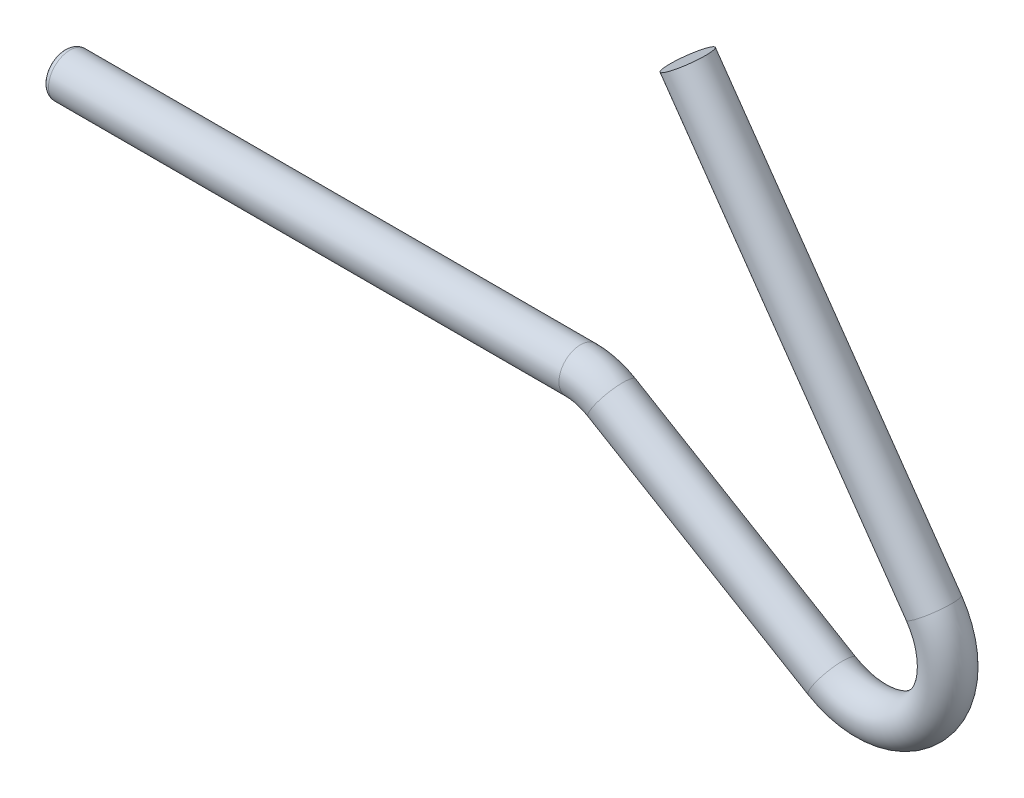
ISO-10303-21;
HEADER;
FILE_DESCRIPTION(('STEP AP214'),'2;1');
FILE_NAME('part.step','',(''),(''),'','','');
FILE_SCHEMA(('AUTOMOTIVE_DESIGN { 1 0 10303 214 1 1 1 1 }'));
ENDSEC;
DATA;
#1=APPLICATION_CONTEXT('core data for automotive mechanical design processes');
#2=APPLICATION_PROTOCOL_DEFINITION('international standard','automotive_design',2000,#1);
#3=PRODUCT_CONTEXT('',#1,'mechanical');
#4=PRODUCT('Part','Part','',(#3));
#5=PRODUCT_RELATED_PRODUCT_CATEGORY('part','',(#4));
#6=PRODUCT_DEFINITION_FORMATION('','',#4);
#7=PRODUCT_DEFINITION_CONTEXT('part definition',#1,'design');
#8=PRODUCT_DEFINITION('design','',#6,#7);
#9=PRODUCT_DEFINITION_SHAPE('','',#8);
#10=(LENGTH_UNIT() NAMED_UNIT(*) SI_UNIT(.MILLI.,.METRE.));
#11=(NAMED_UNIT(*) PLANE_ANGLE_UNIT() SI_UNIT($,.RADIAN.));
#12=(NAMED_UNIT(*) SI_UNIT($,.STERADIAN.) SOLID_ANGLE_UNIT());
#13=UNCERTAINTY_MEASURE_WITH_UNIT(LENGTH_MEASURE(1.E-05),#10,'distance_accuracy_value','');
#14=(GEOMETRIC_REPRESENTATION_CONTEXT(3) GLOBAL_UNCERTAINTY_ASSIGNED_CONTEXT((#13)) GLOBAL_UNIT_ASSIGNED_CONTEXT((#10,
#11,#12)) REPRESENTATION_CONTEXT('',''));
#15=CARTESIAN_POINT('',(0.,0.,0.));
#16=DIRECTION('',(0.,0.,1.));
#17=DIRECTION('',(1.,0.,0.));
#18=AXIS2_PLACEMENT_3D('',#15,#16,#17);
#19=CARTESIAN_POINT('',(141.893147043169,-4.83029454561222,0.));
#20=DIRECTION('',(-0.573576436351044,0.819152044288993,0.));
#21=DIRECTION('',(-0.819152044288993,-0.573576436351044,0.));
#22=AXIS2_PLACEMENT_3D('',#19,#20,#21);
#23=CYLINDRICAL_SURFACE('',#22,3.5);
#24=CARTESIAN_POINT('',(141.893147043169,-4.83029454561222,0.));
#25=DIRECTION('',(-0.573576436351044,0.819152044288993,0.));
#26=DIRECTION('',(0.,0.,-1.));
#27=AXIS2_PLACEMENT_3D('',#24,#25,#26);
#28=CIRCLE('',#27,3.5);
#29=CARTESIAN_POINT('',(144.76017919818,-2.82277701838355,0.));
#30=VERTEX_POINT('',#29);
#31=EDGE_CURVE('E45',#30,#30,#28,.T.);
#32=ORIENTED_EDGE('',*,*,#31,.T.);
#33=EDGE_LOOP('',(#32));
#34=FACE_BOUND('',#33,.T.);
#35=CARTESIAN_POINT('',(101.742796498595,52.5103485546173,0.));
#36=DIRECTION('',(-0.573576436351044,0.819152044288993,0.));
#37=DIRECTION('',(0.,0.,-1.));
#38=AXIS2_PLACEMENT_3D('',#35,#36,#37);
#39=CIRCLE('',#38,3.5);
#40=CARTESIAN_POINT('',(101.742796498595,52.5103485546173,-3.5));
#41=VERTEX_POINT('',#40);
#42=EDGE_CURVE('E41',#41,#41,#39,.T.);
#43=ORIENTED_EDGE('',*,*,#42,.F.);
#44=EDGE_LOOP('',(#43));
#45=FACE_BOUND('',#44,.T.);
#46=ADVANCED_FACE('F31',(#34,#45),#23,.T.);
#47=CARTESIAN_POINT('',(131.653746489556,-12.0000000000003,0.));
#48=DIRECTION('',(0.,0.,1.));
#49=DIRECTION('',(1.,0.,0.));
#50=AXIS2_PLACEMENT_3D('',#47,#48,#49);
#51=TOROIDAL_SURFACE('',#50,12.5,3.5);
#52=CARTESIAN_POINT('',(125.266993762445,-22.7452030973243,0.));
#53=DIRECTION('',(0.859616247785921,-0.510940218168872,0.));
#54=DIRECTION('',(0.,0.,-1.));
#55=AXIS2_PLACEMENT_3D('',#52,#53,#54);
#56=CIRCLE('',#55,3.5);
#57=CARTESIAN_POINT('',(123.478702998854,-25.753859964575,0.));
#58=VERTEX_POINT('',#57);
#59=EDGE_CURVE('E50',#58,#58,#56,.T.);
#60=CARTESIAN_POINT('',(131.653746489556,-12.0000000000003,0.));
#61=DIRECTION('',(0.,0.,1.));
#62=DIRECTION('',(1.,0.,0.));
#63=AXIS2_PLACEMENT_3D('',#60,#61,#62);
#64=CIRCLE('',#63,16.);
#65=EDGE_CURVE('',#58,#30,#64,.T.);
#66=ORIENTED_EDGE('',*,*,#59,.T.);
#67=ORIENTED_EDGE('',*,*,#31,.F.);
#68=ORIENTED_EDGE('',*,*,#65,.T.);
#69=ORIENTED_EDGE('',*,*,#65,.F.);
#70=EDGE_LOOP('',(#66,#68,#67,#69));
#71=FACE_BOUND('',#70,.T.);
#72=ADVANCED_FACE('F77',(#71),#51,.T.);
#73=CARTESIAN_POINT('',(89.3618448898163,-1.40383752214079,0.));
#74=DIRECTION('',(0.859616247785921,-0.510940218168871,0.));
#75=DIRECTION('',(0.510940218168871,0.859616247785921,0.));
#76=AXIS2_PLACEMENT_3D('',#73,#74,#75);
#77=CYLINDRICAL_SURFACE('',#76,3.5);
#78=CARTESIAN_POINT('',(89.3618448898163,-1.40383752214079,0.));
#79=DIRECTION('',(0.859616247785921,-0.510940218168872,0.));
#80=DIRECTION('',(0.,0.,-1.));
#81=AXIS2_PLACEMENT_3D('',#78,#79,#80);
#82=CIRCLE('',#81,3.5);
#83=CARTESIAN_POINT('',(91.1501356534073,1.60481934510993,0.));
#84=VERTEX_POINT('',#83);
#85=EDGE_CURVE('E53',#84,#84,#82,.T.);
#86=ORIENTED_EDGE('',*,*,#85,.T.);
#87=EDGE_LOOP('',(#86));
#88=FACE_BOUND('',#87,.T.);
#89=ORIENTED_EDGE('',*,*,#59,.F.);
#90=EDGE_LOOP('',(#89));
#91=FACE_BOUND('',#90,.T.);
#92=ADVANCED_FACE('F74',(#88,#91),#77,.T.);
#93=CARTESIAN_POINT('',(84.2524427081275,-10.,0.));
#94=DIRECTION('',(0.,0.,-1.));
#95=DIRECTION('',(-1.,0.,0.));
#96=AXIS2_PLACEMENT_3D('',#93,#94,#95);
#97=TOROIDAL_SURFACE('',#96,10.,3.5);
#98=CARTESIAN_POINT('',(84.2524427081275,0.,0.));
#99=DIRECTION('',(1.,0.,0.));
#100=DIRECTION('',(0.,0.,-1.));
#101=AXIS2_PLACEMENT_3D('',#98,#99,#100);
#102=CIRCLE('',#101,3.5);
#103=CARTESIAN_POINT('',(84.2524427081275,3.5,0.));
#104=VERTEX_POINT('',#103);
#105=EDGE_CURVE('E56',#104,#104,#102,.T.);
#106=CARTESIAN_POINT('',(84.2524427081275,-10.,0.));
#107=DIRECTION('',(0.,0.,-1.));
#108=DIRECTION('',(-1.,0.,0.));
#109=AXIS2_PLACEMENT_3D('',#106,#107,#108);
#110=CIRCLE('',#109,13.5);
#111=EDGE_CURVE('',#104,#84,#110,.T.);
#112=ORIENTED_EDGE('',*,*,#105,.T.);
#113=ORIENTED_EDGE('',*,*,#85,.F.);
#114=ORIENTED_EDGE('',*,*,#111,.T.);
#115=ORIENTED_EDGE('',*,*,#111,.F.);
#116=EDGE_LOOP('',(#112,#114,#113,#115));
#117=FACE_BOUND('',#116,.T.);
#118=ADVANCED_FACE('F60',(#117),#97,.T.);
#119=CARTESIAN_POINT('',(84.2524427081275,0.,0.));
#120=DIRECTION('',(-1.,0.,0.));
#121=DIRECTION('',(0.,-1.,0.));
#122=AXIS2_PLACEMENT_3D('',#119,#120,#121);
#123=CYLINDRICAL_SURFACE('',#122,3.5);
#124=CARTESIAN_POINT('',(0.999999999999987,0.,0.));
#125=DIRECTION('',(1.,0.,0.));
#126=DIRECTION('',(0.,0.,-1.));
#127=AXIS2_PLACEMENT_3D('',#124,#125,#126);
#128=CIRCLE('',#127,3.5);
#129=CARTESIAN_POINT('',(0.999999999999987,0.,-3.5));
#130=VERTEX_POINT('',#129);
#131=EDGE_CURVE('E37',#130,#130,#128,.T.);
#132=ORIENTED_EDGE('',*,*,#131,.T.);
#133=EDGE_LOOP('',(#132));
#134=FACE_BOUND('',#133,.T.);
#135=ORIENTED_EDGE('',*,*,#105,.F.);
#136=EDGE_LOOP('',(#135));
#137=FACE_BOUND('',#136,.T.);
#138=ADVANCED_FACE('F63',(#134,#137),#123,.T.);
#139=CARTESIAN_POINT('',(101.742796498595,52.5103485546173,0.));
#140=DIRECTION('',(-0.573576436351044,0.819152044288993,0.));
#141=DIRECTION('',(0.,0.,-1.));
#142=AXIS2_PLACEMENT_3D('',#139,#140,#141);
#143=PLANE('',#142);
#144=ORIENTED_EDGE('',*,*,#42,.T.);
#145=EDGE_LOOP('',(#144));
#146=FACE_BOUND('',#145,.T.);
#147=ADVANCED_FACE('F65',(#146),#143,.T.);
#148=CARTESIAN_POINT('',(0.,0.,0.));
#149=DIRECTION('',(1.,0.,0.));
#150=DIRECTION('',(0.,0.,-1.));
#151=AXIS2_PLACEMENT_3D('',#148,#149,#150);
#152=PLANE('',#151);
#153=CARTESIAN_POINT('',(0.,0.,0.));
#154=DIRECTION('',(1.,0.,0.));
#155=DIRECTION('',(0.,0.,-1.));
#156=AXIS2_PLACEMENT_3D('',#153,#154,#155);
#157=CIRCLE('',#156,2.5);
#158=CARTESIAN_POINT('',(0.,0.,-2.5));
#159=VERTEX_POINT('',#158);
#160=EDGE_CURVE('E10',#159,#159,#157,.F.);
#161=ORIENTED_EDGE('',*,*,#160,.T.);
#162=EDGE_LOOP('',(#161));
#163=FACE_BOUND('',#162,.T.);
#164=ADVANCED_FACE('F71',(#163),#152,.F.);
#165=CARTESIAN_POINT('',(1.,0.,0.));
#166=DIRECTION('',(1.,0.,0.));
#167=DIRECTION('',(0.,0.,-1.));
#168=AXIS2_PLACEMENT_3D('',#165,#166,#167);
#169=TOROIDAL_SURFACE('',#168,2.5,1.);
#170=ORIENTED_EDGE('',*,*,#160,.F.);
#171=EDGE_LOOP('',(#170));
#172=FACE_BOUND('',#171,.T.);
#173=ORIENTED_EDGE('',*,*,#131,.F.);
#174=EDGE_LOOP('',(#173));
#175=FACE_BOUND('',#174,.T.);
#176=ADVANCED_FACE('F114',(#172,#175),#169,.T.);
#177=CLOSED_SHELL('',(#46,#72,#92,#118,#138,#147,#164,#176));
#178=MANIFOLD_SOLID_BREP('B2',#177);
#179=ADVANCED_BREP_SHAPE_REPRESENTATION('',(#18,#178),#14);
#180=SHAPE_DEFINITION_REPRESENTATION(#9,#179);
ENDSEC;
END-ISO-10303-21;
